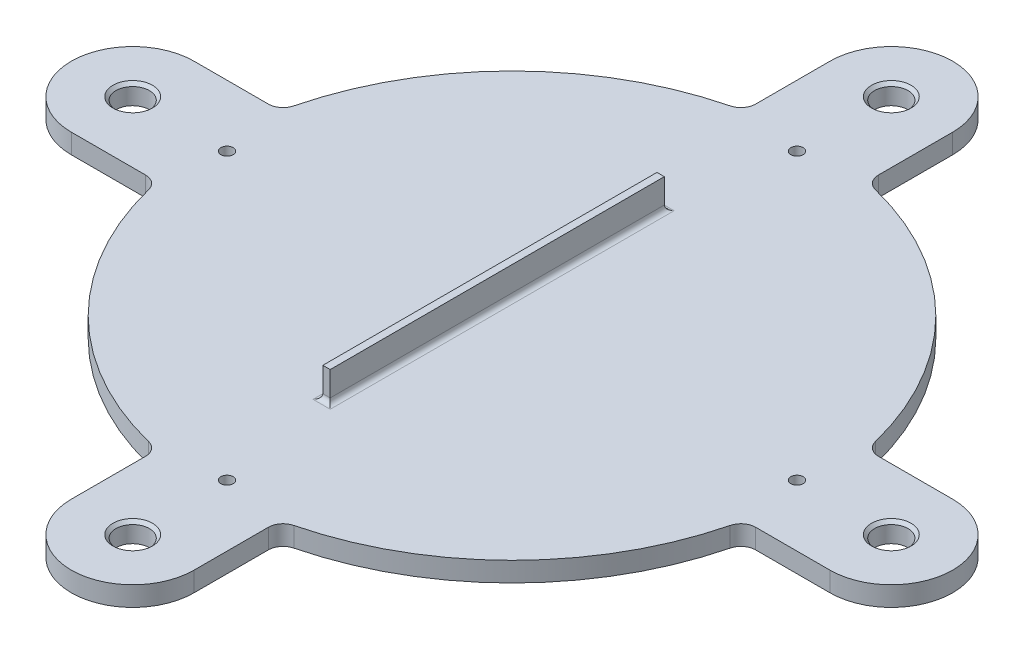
from build123d import *

# Parameters (mm, degrees)
BOSS_EXTRUDE1_DEPTH        = 4
FILLET1_R                  = 3
SKETCH6_W                  = 1.5
SKETCH6_H                  = 68
BOSS_EXTRUDE2_DEPTH        = 6
SKETCH7_R                  = 3
CUT_EXTRUDE1_DEPTH         = 2
M3_TAPPED_HOLE2_D          = 2.5
FILLET3_RADIUS             = 12.5
FILLET3_LENGTH             = 4
FILLET4_RADIUS             = 12.5
FILLET4_LENGTH             = 4
FILLET5_RADIUS             = 12.5
FILLET5_LENGTH             = 4
FILLET6_RADIUS             = 12.5
FILLET6_LENGTH             = 4
M8_TAPPED_HOLE1_AT_2_COUNT = 2
M8_TAPPED_HOLE1_AT_2_PITCH = 109.185103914
M8_TAPPED_HOLE1_AT_3_COUNT = 2
M8_TAPPED_HOLE1_AT_3_PITCH = 154.411054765
M8_TAPPED_HOLE1_AT_4_COUNT = 2
M8_TAPPED_HOLE1_AT_4_PITCH = 109.185103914
FILLET7_R                  = 1


with BuildPart() as part:
    # Sketch1 → Boss-Extrude1 (new body)
    with BuildSketch(Plane(origin=(0, 0, 0), x_dir=(1, 0, 0), z_dir=(0, 1, 0))):
        with BuildLine():
            Line((-12.5, 59.705527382), (-12.5, 89.705527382))
            Line((-12.5, 89.705527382), (12.5, 89.705527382))
            Line((12.5, 89.705527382), (12.5, 59.705527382))
            ThreePointArc((12.5, 59.705527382), (43.133513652, 43.133513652), (59.705527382, 12.5))
            Line((59.705527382, 12.5), (89.705527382, 12.5))
            Line((89.705527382, 12.5), (89.705527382, -12.5))
            Line((89.705527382, -12.5), (59.705527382, -12.5))
            ThreePointArc((59.705527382, -12.5), (43.133513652, -43.133513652), (12.5, -59.705527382))
            Line((12.5, -59.705527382), (12.5, -89.705527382))
            Line((12.5, -89.705527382), (-12.5, -89.705527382))
            Line((-12.5, -89.705527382), (-12.5, -59.705527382))
            ThreePointArc((-12.5, -59.705527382), (-43.133513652, -43.133513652), (-59.705527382, -12.5))
            Line((-59.705527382, -12.5), (-89.705527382, -12.5))
            Line((-89.705527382, -12.5), (-89.705527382, 12.5))
            Line((-89.705527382, 12.5), (-59.705527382, 12.5))
            ThreePointArc((-59.705527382, 12.5), (-43.133513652, 43.133513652), (-12.5, 59.705527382))
        make_face()
    extrude(amount=-BOSS_EXTRUDE1_DEPTH)

    # Fillet1
    fillet1_edges = [part.edges().sort_by_distance(p)[0] for p in [
        (-12.5, -2, -59.705527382),
        (12.5, -2, -59.705527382),
        (59.705527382, -2, -12.5),
        (59.705527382, -2, 12.5),
        (12.5, -2, 59.705527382),
        (-12.5, -2, 59.705527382),
        (-59.705527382, -2, 12.5),
        (-59.705527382, -2, -12.5),
    ]]
    fillet(fillet1_edges, radius=FILLET1_R)

    # Sketch6 → Boss-Extrude2 (add)
    with BuildSketch(Plane(origin=(0, 0, 0), x_dir=(1, 0, 0), z_dir=(0, 1, 0))):
        with Locations((-3.75, 0)):
            Rectangle(SKETCH6_W, SKETCH6_H)
    extrude(amount=BOSS_EXTRUDE2_DEPTH)

    # Sketch7 → Cut-Extrude1 (cut)
    with BuildSketch(Plane.XZ.offset(4)):
        with Locations(Location((0, 58, 0), (0, 0, 270))):
            Circle(SKETCH7_R)
        with Locations(Location((58, 0, 0), (0, 0, 270))):
            Circle(SKETCH7_R)
        with Locations(Location((0, -58, 0), (0, 0, 270))):
            Circle(SKETCH7_R)
        with Locations(Location((-58, 0, 0), (0, 0, 270))):
            Circle(SKETCH7_R)
    extrude(amount=-CUT_EXTRUDE1_DEPTH, mode=Mode.SUBTRACT)

    # M3 Tapped Hole2 (through all)
    with Locations(Plane.XZ.offset(2)):
        with Locations((0, -58), (-58, 0), (58, 0), (0, 58)):
            Hole(M3_TAPPED_HOLE2_D / 2)

    # Fillet3: full round fillet: the end face becomes a half cylinder, R = half its width
    fillet3_face = Plane((0, -2, 89.705527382), x_dir=(0, 1, 0), z_dir=(0, 0, 1))  # on the end face: x along it, z out of the body
    fillet3_slab = fillet3_face.offset(-FILLET3_RADIUS / 2) * Box(FILLET3_LENGTH, 2 * FILLET3_RADIUS, FILLET3_RADIUS, mode=Mode.PRIVATE)  # the body's end, R deep
    fillet3_round = Plane((0, -2, 77.205527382), x_dir=(0, 0, 1), z_dir=(0, 1, 0)) * Cylinder(FILLET3_RADIUS, FILLET3_LENGTH, mode=Mode.PRIVATE)  # its axis R under the face
    add(fillet3_slab - fillet3_round, mode=Mode.SUBTRACT)

    # Fillet4: full round fillet: the end face becomes a half cylinder, R = half its width
    fillet4_face = Plane((89.705527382, -2, 0), x_dir=(0, 1, 0), z_dir=(1, 0, 0))  # on the end face: x along it, z out of the body
    fillet4_slab = fillet4_face.offset(-FILLET4_RADIUS / 2) * Box(FILLET4_LENGTH, 2 * FILLET4_RADIUS, FILLET4_RADIUS, mode=Mode.PRIVATE)  # the body's end, R deep
    fillet4_round = Plane((77.205527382, -2, 0), x_dir=(1, 0, 0), z_dir=(0, 1, 0)) * Cylinder(FILLET4_RADIUS, FILLET4_LENGTH, mode=Mode.PRIVATE)  # its axis R under the face
    add(fillet4_slab - fillet4_round, mode=Mode.SUBTRACT)

    # Fillet5: full round fillet: the end face becomes a half cylinder, R = half its width
    fillet5_face = Plane((-89.705527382, -2, 0), x_dir=(0, 1, 0), z_dir=(-1, 0, 0))  # on the end face: x along it, z out of the body
    fillet5_slab = fillet5_face.offset(-FILLET5_RADIUS / 2) * Box(FILLET5_LENGTH, 2 * FILLET5_RADIUS, FILLET5_RADIUS, mode=Mode.PRIVATE)  # the body's end, R deep
    fillet5_round = Plane((-77.205527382, -2, 0), x_dir=(-1, 0, 0), z_dir=(0, 1, 0)) * Cylinder(FILLET5_RADIUS, FILLET5_LENGTH, mode=Mode.PRIVATE)  # its axis R under the face
    add(fillet5_slab - fillet5_round, mode=Mode.SUBTRACT)

    # Fillet6: full round fillet: the end face becomes a half cylinder, R = half its width
    fillet6_face = Plane((0, -2, -89.705527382), x_dir=(0, 1, 0), z_dir=(0, 0, -1))  # on the end face: x along it, z out of the body
    fillet6_slab = fillet6_face.offset(-FILLET6_RADIUS / 2) * Box(FILLET6_LENGTH, 2 * FILLET6_RADIUS, FILLET6_RADIUS, mode=Mode.PRIVATE)  # the body's end, R deep
    fillet6_round = Plane((0, -2, -77.205527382), x_dir=(0, 0, -1), z_dir=(0, 1, 0)) * Cylinder(FILLET6_RADIUS, FILLET6_LENGTH, mode=Mode.PRIVATE)  # its axis R under the face
    add(fillet6_slab - fillet6_round, mode=Mode.SUBTRACT)

    # Sketch9 → M8 Tapped Hole1 (revolve, cut)
    with BuildSketch(Plane(origin=(-77.205527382, 0, 0), x_dir=(0, 0, 1), z_dir=(1, 0, 0))):
        Polygon((0, 0), (0, 4), (3.4, 4), (3.4, 0.625), (4.025, 0), align=None)
    m8_tapped_hole1 = revolve(axis=Axis((-77.205527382, 6.35, 0), (0, -1, 0)), mode=Mode.SUBTRACT)

    # M8 Tapped Hole1 at 2: M8 Tapped Hole1 ×2
    with Locations(*[Vector(0.7071067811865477, 0, 0.7071067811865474) * (i * M8_TAPPED_HOLE1_AT_2_PITCH) for i in range(1, M8_TAPPED_HOLE1_AT_2_COUNT)]):
        add(m8_tapped_hole1, mode=Mode.SUBTRACT)

    # M8 Tapped Hole1 at 3: M8 Tapped Hole1 ×2
    with Locations(*[(i * M8_TAPPED_HOLE1_AT_3_PITCH, 0, 0) for i in range(1, M8_TAPPED_HOLE1_AT_3_COUNT)]):
        add(m8_tapped_hole1, mode=Mode.SUBTRACT)

    # M8 Tapped Hole1 at 4: M8 Tapped Hole1 ×2
    with Locations(*[Vector(0.7071067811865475, 0, -0.7071067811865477) * (i * M8_TAPPED_HOLE1_AT_4_PITCH) for i in range(1, M8_TAPPED_HOLE1_AT_4_COUNT)]):
        add(m8_tapped_hole1, mode=Mode.SUBTRACT)

    # Fillet7
    fillet7_edges = [part.edges().sort_by_distance(p)[0] for p in [
        (-3.75, 0, 34),
        (-3, 0, 0),
        (-4.5, 0, 0),
        (-3.75, 0, -34),
    ]]
    fillet(fillet7_edges, radius=FILLET7_R)


solid = part.part
